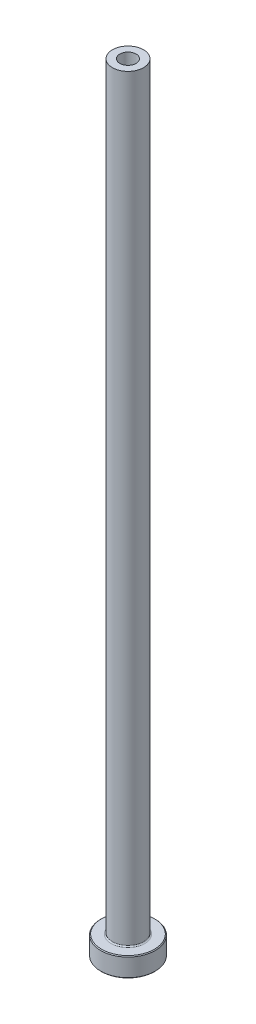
ISO-10303-21;
HEADER;
FILE_DESCRIPTION(('STEP AP214'),'2;1');
FILE_NAME('part.step','',(''),(''),'','','');
FILE_SCHEMA(('AUTOMOTIVE_DESIGN { 1 0 10303 214 1 1 1 1 }'));
ENDSEC;
DATA;
#1=APPLICATION_CONTEXT('core data for automotive mechanical design processes');
#2=APPLICATION_PROTOCOL_DEFINITION('international standard','automotive_design',2000,#1);
#3=PRODUCT_CONTEXT('',#1,'mechanical');
#4=PRODUCT('Part','Part','',(#3));
#5=PRODUCT_RELATED_PRODUCT_CATEGORY('part','',(#4));
#6=PRODUCT_DEFINITION_FORMATION('','',#4);
#7=PRODUCT_DEFINITION_CONTEXT('part definition',#1,'design');
#8=PRODUCT_DEFINITION('design','',#6,#7);
#9=PRODUCT_DEFINITION_SHAPE('','',#8);
#10=(LENGTH_UNIT() NAMED_UNIT(*) SI_UNIT(.MILLI.,.METRE.));
#11=(NAMED_UNIT(*) PLANE_ANGLE_UNIT() SI_UNIT($,.RADIAN.));
#12=(NAMED_UNIT(*) SI_UNIT($,.STERADIAN.) SOLID_ANGLE_UNIT());
#13=UNCERTAINTY_MEASURE_WITH_UNIT(LENGTH_MEASURE(1.E-05),#10,'distance_accuracy_value','');
#14=(GEOMETRIC_REPRESENTATION_CONTEXT(3) GLOBAL_UNCERTAINTY_ASSIGNED_CONTEXT((#13)) GLOBAL_UNIT_ASSIGNED_CONTEXT((#10,
#11,#12)) REPRESENTATION_CONTEXT('',''));
#15=CARTESIAN_POINT('',(0.,0.,0.));
#16=DIRECTION('',(0.,0.,1.));
#17=DIRECTION('',(1.,0.,0.));
#18=AXIS2_PLACEMENT_3D('',#15,#16,#17);
#19=CARTESIAN_POINT('',(0.,92.1876809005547,0.));
#20=DIRECTION('',(0.,1.,0.));
#21=DIRECTION('',(0.,0.,1.));
#22=AXIS2_PLACEMENT_3D('',#19,#20,#21);
#23=CYLINDRICAL_SURFACE('',#22,2.1);
#24=CARTESIAN_POINT('',(0.,200.,0.));
#25=DIRECTION('',(0.,1.,0.));
#26=DIRECTION('',(0.,0.,1.));
#27=AXIS2_PLACEMENT_3D('',#24,#25,#26);
#28=CIRCLE('',#27,2.1);
#29=CARTESIAN_POINT('',(0.,200.,2.1));
#30=VERTEX_POINT('',#29);
#31=EDGE_CURVE('E62',#30,#30,#28,.T.);
#32=ORIENTED_EDGE('',*,*,#31,.T.);
#33=EDGE_LOOP('',(#32));
#34=FACE_BOUND('',#33,.T.);
#35=CARTESIAN_POINT('',(0.,155.,0.));
#36=DIRECTION('',(0.,1.,0.));
#37=DIRECTION('',(0.,0.,1.));
#38=AXIS2_PLACEMENT_3D('',#35,#36,#37);
#39=CIRCLE('',#38,2.1);
#40=CARTESIAN_POINT('',(0.,155.,2.1));
#41=VERTEX_POINT('',#40);
#42=EDGE_CURVE('E71',#41,#41,#39,.T.);
#43=ORIENTED_EDGE('',*,*,#42,.F.);
#44=EDGE_LOOP('',(#43));
#45=FACE_BOUND('',#44,.T.);
#46=ADVANCED_FACE('F30',(#34,#45),#23,.F.);
#47=CARTESIAN_POINT('',(-2.1,200.,0.));
#48=DIRECTION('',(0.,1.,0.));
#49=DIRECTION('',(0.,0.,1.));
#50=AXIS2_PLACEMENT_3D('',#47,#48,#49);
#51=PLANE('',#50);
#52=CARTESIAN_POINT('',(0.,200.,0.));
#53=DIRECTION('',(0.,1.,0.));
#54=DIRECTION('',(0.,0.,1.));
#55=AXIS2_PLACEMENT_3D('',#52,#53,#54);
#56=CIRCLE('',#55,4.00000000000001);
#57=CARTESIAN_POINT('',(0.,200.,4.00000000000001));
#58=VERTEX_POINT('',#57);
#59=EDGE_CURVE('E65',#58,#58,#56,.T.);
#60=ORIENTED_EDGE('',*,*,#59,.T.);
#61=EDGE_LOOP('',(#60));
#62=FACE_BOUND('',#61,.T.);
#63=ORIENTED_EDGE('',*,*,#31,.F.);
#64=EDGE_LOOP('',(#63));
#65=FACE_BOUND('',#64,.T.);
#66=ADVANCED_FACE('F79',(#62,#65),#51,.T.);
#67=CARTESIAN_POINT('',(0.,92.1876809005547,0.));
#68=DIRECTION('',(0.,1.,0.));
#69=DIRECTION('',(0.,0.,1.));
#70=AXIS2_PLACEMENT_3D('',#67,#68,#69);
#71=CYLINDRICAL_SURFACE('',#70,4.);
#72=CARTESIAN_POINT('',(0.,5.3,0.));
#73=DIRECTION('',(0.,1.,0.));
#74=DIRECTION('',(0.,0.,1.));
#75=AXIS2_PLACEMENT_3D('',#72,#73,#74);
#76=CIRCLE('',#75,4.);
#77=CARTESIAN_POINT('',(0.,5.3,4.));
#78=VERTEX_POINT('',#77);
#79=EDGE_CURVE('E59',#78,#78,#76,.T.);
#80=ORIENTED_EDGE('',*,*,#79,.T.);
#81=EDGE_LOOP('',(#80));
#82=FACE_BOUND('',#81,.T.);
#83=ORIENTED_EDGE('',*,*,#59,.F.);
#84=EDGE_LOOP('',(#83));
#85=FACE_BOUND('',#84,.T.);
#86=ADVANCED_FACE('F85',(#82,#85),#71,.T.);
#87=CARTESIAN_POINT('',(-3.99999999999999,5.,0.));
#88=DIRECTION('',(0.,1.,0.));
#89=DIRECTION('',(0.,0.,1.));
#90=AXIS2_PLACEMENT_3D('',#87,#88,#89);
#91=PLANE('',#90);
#92=CARTESIAN_POINT('',(0.,5.,0.));
#93=DIRECTION('',(0.,1.,0.));
#94=DIRECTION('',(0.,0.,1.));
#95=AXIS2_PLACEMENT_3D('',#92,#93,#94);
#96=CIRCLE('',#95,6.80000000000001);
#97=CARTESIAN_POINT('',(0.,5.,6.80000000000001));
#98=VERTEX_POINT('',#97);
#99=EDGE_CURVE('E53',#98,#98,#96,.T.);
#100=ORIENTED_EDGE('',*,*,#99,.T.);
#101=EDGE_LOOP('',(#100));
#102=FACE_BOUND('',#101,.T.);
#103=CARTESIAN_POINT('',(0.,5.,0.));
#104=DIRECTION('',(0.,1.,0.));
#105=DIRECTION('',(0.,0.,1.));
#106=AXIS2_PLACEMENT_3D('',#103,#104,#105);
#107=CIRCLE('',#106,4.3);
#108=CARTESIAN_POINT('',(0.,5.,4.3));
#109=VERTEX_POINT('',#108);
#110=EDGE_CURVE('E56',#109,#109,#107,.F.);
#111=ORIENTED_EDGE('',*,*,#110,.T.);
#112=EDGE_LOOP('',(#111));
#113=FACE_BOUND('',#112,.T.);
#114=ADVANCED_FACE('F111',(#102,#113),#91,.T.);
#115=CARTESIAN_POINT('',(0.,92.1876809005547,0.));
#116=DIRECTION('',(0.,1.,0.));
#117=DIRECTION('',(0.,0.,1.));
#118=AXIS2_PLACEMENT_3D('',#115,#116,#117);
#119=CYLINDRICAL_SURFACE('',#118,6.99999999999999);
#120=CARTESIAN_POINT('',(0.,4.8,0.));
#121=DIRECTION('',(0.,1.,0.));
#122=DIRECTION('',(0.,0.,1.));
#123=AXIS2_PLACEMENT_3D('',#120,#121,#122);
#124=CIRCLE('',#123,6.99999999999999);
#125=CARTESIAN_POINT('',(0.,4.8,6.99999999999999));
#126=VERTEX_POINT('',#125);
#127=EDGE_CURVE('E45',#126,#126,#124,.F.);
#128=ORIENTED_EDGE('',*,*,#127,.T.);
#129=EDGE_LOOP('',(#128));
#130=FACE_BOUND('',#129,.T.);
#131=CARTESIAN_POINT('',(0.,0.20000000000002,0.));
#132=DIRECTION('',(0.,-1.,0.));
#133=DIRECTION('',(0.,0.,-1.));
#134=AXIS2_PLACEMENT_3D('',#131,#132,#133);
#135=CIRCLE('',#134,6.99999999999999);
#136=CARTESIAN_POINT('',(0.,0.20000000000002,-6.99999999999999));
#137=VERTEX_POINT('',#136);
#138=EDGE_CURVE('E50',#137,#137,#135,.F.);
#139=ORIENTED_EDGE('',*,*,#138,.T.);
#140=EDGE_LOOP('',(#139));
#141=FACE_BOUND('',#140,.T.);
#142=ADVANCED_FACE('F108',(#130,#141),#119,.T.);
#143=CARTESIAN_POINT('',(-6.99999999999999,0.,0.));
#144=DIRECTION('',(0.,-1.,0.));
#145=DIRECTION('',(0.,0.,-1.));
#146=AXIS2_PLACEMENT_3D('',#143,#144,#145);
#147=PLANE('',#146);
#148=CARTESIAN_POINT('',(0.,0.,0.));
#149=DIRECTION('',(0.,-1.,0.));
#150=DIRECTION('',(0.,0.,-1.));
#151=AXIS2_PLACEMENT_3D('',#148,#149,#150);
#152=CIRCLE('',#151,2.85000000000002);
#153=CARTESIAN_POINT('',(0.,0.,-2.85000000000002));
#154=VERTEX_POINT('',#153);
#155=EDGE_CURVE('E37',#154,#154,#152,.F.);
#156=ORIENTED_EDGE('',*,*,#155,.T.);
#157=EDGE_LOOP('',(#156));
#158=FACE_BOUND('',#157,.T.);
#159=CARTESIAN_POINT('',(0.,0.,0.));
#160=DIRECTION('',(0.,-1.,0.));
#161=DIRECTION('',(0.,0.,-1.));
#162=AXIS2_PLACEMENT_3D('',#159,#160,#161);
#163=CIRCLE('',#162,6.79999999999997);
#164=CARTESIAN_POINT('',(0.,0.,-6.79999999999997));
#165=VERTEX_POINT('',#164);
#166=EDGE_CURVE('E41',#165,#165,#163,.T.);
#167=ORIENTED_EDGE('',*,*,#166,.T.);
#168=EDGE_LOOP('',(#167));
#169=FACE_BOUND('',#168,.T.);
#170=ADVANCED_FACE('F110',(#158,#169),#147,.T.);
#171=CARTESIAN_POINT('',(0.,92.1876809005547,0.));
#172=DIRECTION('',(0.,1.,0.));
#173=DIRECTION('',(0.,0.,1.));
#174=AXIS2_PLACEMENT_3D('',#171,#172,#173);
#175=CYLINDRICAL_SURFACE('',#174,2.35);
#176=CARTESIAN_POINT('',(0.,0.500000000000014,0.));
#177=DIRECTION('',(0.,-1.,0.));
#178=DIRECTION('',(0.,0.,-1.));
#179=AXIS2_PLACEMENT_3D('',#176,#177,#178);
#180=CIRCLE('',#179,2.35);
#181=CARTESIAN_POINT('',(0.,0.500000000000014,-2.35));
#182=VERTEX_POINT('',#181);
#183=EDGE_CURVE('E10',#182,#182,#180,.T.);
#184=ORIENTED_EDGE('',*,*,#183,.T.);
#185=EDGE_LOOP('',(#184));
#186=FACE_BOUND('',#185,.T.);
#187=CARTESIAN_POINT('',(0.,143.,0.));
#188=DIRECTION('',(0.,1.,0.));
#189=DIRECTION('',(0.,0.,1.));
#190=AXIS2_PLACEMENT_3D('',#187,#188,#189);
#191=CIRCLE('',#190,2.35000000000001);
#192=CARTESIAN_POINT('',(0.,143.,2.35000000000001));
#193=VERTEX_POINT('',#192);
#194=EDGE_CURVE('E68',#193,#193,#191,.T.);
#195=ORIENTED_EDGE('',*,*,#194,.T.);
#196=EDGE_LOOP('',(#195));
#197=FACE_BOUND('',#196,.T.);
#198=ADVANCED_FACE('F118',(#186,#197),#175,.F.);
#199=CARTESIAN_POINT('',(0.,143.,0.));
#200=DIRECTION('',(0.,-1.,0.));
#201=DIRECTION('',(0.,0.,-1.));
#202=AXIS2_PLACEMENT_3D('',#199,#200,#201);
#203=CONICAL_SURFACE('',#202,2.35000000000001,0.0208303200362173);
#204=ORIENTED_EDGE('',*,*,#42,.T.);
#205=EDGE_LOOP('',(#204));
#206=FACE_BOUND('',#205,.T.);
#207=ORIENTED_EDGE('',*,*,#194,.F.);
#208=EDGE_LOOP('',(#207));
#209=FACE_BOUND('',#208,.T.);
#210=ADVANCED_FACE('F75',(#206,#209),#203,.F.);
#211=CARTESIAN_POINT('',(0.,5.3,0.));
#212=DIRECTION('',(0.,1.,0.));
#213=DIRECTION('',(0.,0.,1.));
#214=AXIS2_PLACEMENT_3D('',#211,#212,#213);
#215=TOROIDAL_SURFACE('',#214,4.3,0.3);
#216=ORIENTED_EDGE('',*,*,#110,.F.);
#217=EDGE_LOOP('',(#216));
#218=FACE_BOUND('',#217,.T.);
#219=ORIENTED_EDGE('',*,*,#79,.F.);
#220=EDGE_LOOP('',(#219));
#221=FACE_BOUND('',#220,.T.);
#222=ADVANCED_FACE('F90',(#218,#221),#215,.F.);
#223=CARTESIAN_POINT('',(0.,5.,0.));
#224=DIRECTION('',(0.,-1.,0.));
#225=DIRECTION('',(0.,0.,-1.));
#226=AXIS2_PLACEMENT_3D('',#223,#224,#225);
#227=CONICAL_SURFACE('',#226,6.8,0.785398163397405);
#228=ORIENTED_EDGE('',*,*,#127,.F.);
#229=EDGE_LOOP('',(#228));
#230=FACE_BOUND('',#229,.T.);
#231=ORIENTED_EDGE('',*,*,#99,.F.);
#232=EDGE_LOOP('',(#231));
#233=FACE_BOUND('',#232,.T.);
#234=ADVANCED_FACE('F93',(#230,#233),#227,.T.);
#235=CARTESIAN_POINT('',(0.,0.20000000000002,0.));
#236=DIRECTION('',(0.,1.,0.));
#237=DIRECTION('',(0.,0.,1.));
#238=AXIS2_PLACEMENT_3D('',#235,#236,#237);
#239=CONICAL_SURFACE('',#238,6.99999999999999,0.78539816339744);
#240=ORIENTED_EDGE('',*,*,#166,.F.);
#241=EDGE_LOOP('',(#240));
#242=FACE_BOUND('',#241,.T.);
#243=ORIENTED_EDGE('',*,*,#138,.F.);
#244=EDGE_LOOP('',(#243));
#245=FACE_BOUND('',#244,.T.);
#246=ADVANCED_FACE('F96',(#242,#245),#239,.T.);
#247=CARTESIAN_POINT('',(0.,0.,0.));
#248=DIRECTION('',(0.,-1.,0.));
#249=DIRECTION('',(0.,0.,-1.));
#250=AXIS2_PLACEMENT_3D('',#247,#248,#249);
#251=CONICAL_SURFACE('',#250,2.85000000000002,0.785398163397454);
#252=ORIENTED_EDGE('',*,*,#183,.F.);
#253=EDGE_LOOP('',(#252));
#254=FACE_BOUND('',#253,.T.);
#255=ORIENTED_EDGE('',*,*,#155,.F.);
#256=EDGE_LOOP('',(#255));
#257=FACE_BOUND('',#256,.T.);
#258=ADVANCED_FACE('F32',(#254,#257),#251,.F.);
#259=CLOSED_SHELL('',(#46,#66,#86,#114,#142,#170,#198,#210,#222,#234,#246,#258));
#260=MANIFOLD_SOLID_BREP('B2',#259);
#261=ADVANCED_BREP_SHAPE_REPRESENTATION('',(#18,#260),#14);
#262=SHAPE_DEFINITION_REPRESENTATION(#9,#261);
ENDSEC;
END-ISO-10303-21;
